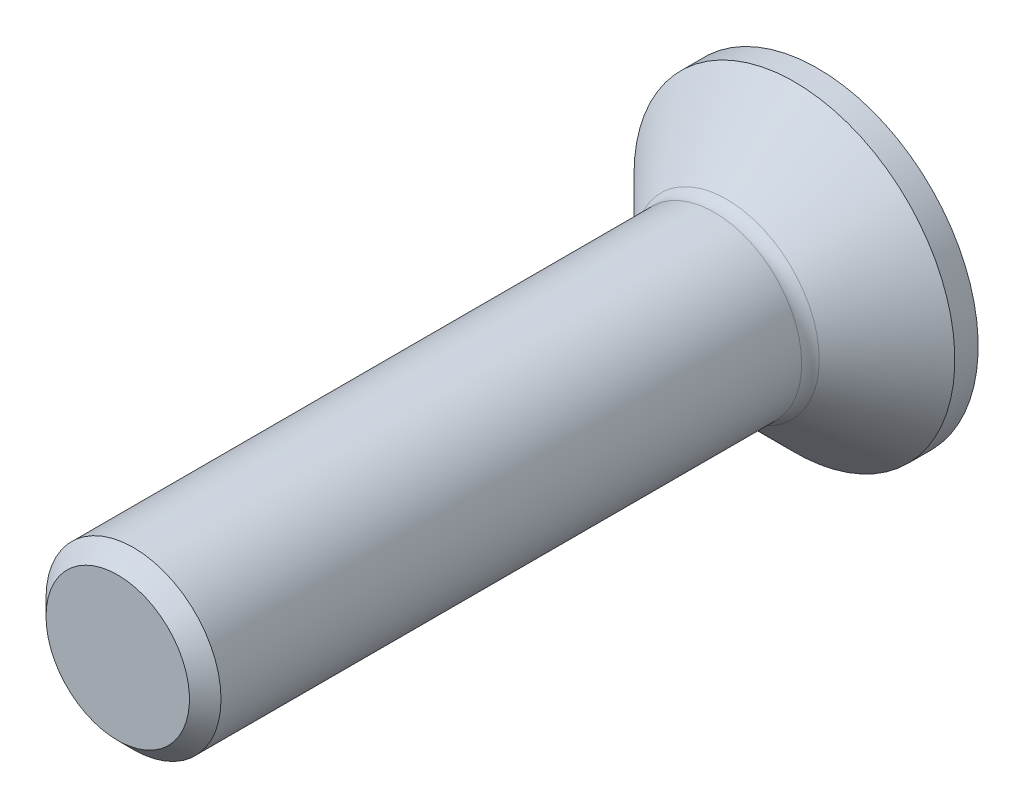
ISO-10303-21;
HEADER;
FILE_DESCRIPTION(('STEP AP214'),'2;1');
FILE_NAME('part.step','',(''),(''),'','','');
FILE_SCHEMA(('AUTOMOTIVE_DESIGN { 1 0 10303 214 1 1 1 1 }'));
ENDSEC;
DATA;
#1=APPLICATION_CONTEXT('core data for automotive mechanical design processes');
#2=APPLICATION_PROTOCOL_DEFINITION('international standard','automotive_design',2000,#1);
#3=PRODUCT_CONTEXT('',#1,'mechanical');
#4=PRODUCT('Part','Part','',(#3));
#5=PRODUCT_RELATED_PRODUCT_CATEGORY('part','',(#4));
#6=PRODUCT_DEFINITION_FORMATION('','',#4);
#7=PRODUCT_DEFINITION_CONTEXT('part definition',#1,'design');
#8=PRODUCT_DEFINITION('design','',#6,#7);
#9=PRODUCT_DEFINITION_SHAPE('','',#8);
#10=(LENGTH_UNIT() NAMED_UNIT(*) SI_UNIT(.MILLI.,.METRE.));
#11=(NAMED_UNIT(*) PLANE_ANGLE_UNIT() SI_UNIT($,.RADIAN.));
#12=(NAMED_UNIT(*) SI_UNIT($,.STERADIAN.) SOLID_ANGLE_UNIT());
#13=UNCERTAINTY_MEASURE_WITH_UNIT(LENGTH_MEASURE(1.E-05),#10,'distance_accuracy_value','');
#14=(GEOMETRIC_REPRESENTATION_CONTEXT(3) GLOBAL_UNCERTAINTY_ASSIGNED_CONTEXT((#13)) GLOBAL_UNIT_ASSIGNED_CONTEXT((#10,
#11,#12)) REPRESENTATION_CONTEXT('',''));
#15=CARTESIAN_POINT('',(0.,0.,0.));
#16=DIRECTION('',(0.,0.,1.));
#17=DIRECTION('',(1.,0.,0.));
#18=AXIS2_PLACEMENT_3D('',#15,#16,#17);
#19=CARTESIAN_POINT('',(0.,0.,-1.65));
#20=DIRECTION('',(0.,0.,-1.));
#21=DIRECTION('',(-1.,0.,0.));
#22=AXIS2_PLACEMENT_3D('',#19,#20,#21);
#23=CONICAL_SURFACE('',#22,3.15000000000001,0.78539816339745);
#24=CARTESIAN_POINT('',(0.,0.,-0.0878679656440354));
#25=DIRECTION('',(0.,0.,-1.));
#26=DIRECTION('',(-1.,0.,0.));
#27=AXIS2_PLACEMENT_3D('',#24,#25,#26);
#28=CIRCLE('',#27,1.58786796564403);
#29=CARTESIAN_POINT('',(-1.58786796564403,0.,-0.0878679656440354));
#30=VERTEX_POINT('',#29);
#31=EDGE_CURVE('E12',#30,#30,#28,.T.);
#32=ORIENTED_EDGE('',*,*,#31,.T.);
#33=EDGE_LOOP('',(#32));
#34=FACE_BOUND('',#33,.T.);
#35=CARTESIAN_POINT('',(0.,0.,-1.25));
#36=DIRECTION('',(0.,0.,-1.));
#37=DIRECTION('',(-1.,0.,0.));
#38=AXIS2_PLACEMENT_3D('',#35,#36,#37);
#39=CIRCLE('',#38,2.75);
#40=CARTESIAN_POINT('',(-2.75,0.,-1.25));
#41=VERTEX_POINT('',#40);
#42=EDGE_CURVE('E31',#41,#41,#39,.T.);
#43=ORIENTED_EDGE('',*,*,#42,.F.);
#44=EDGE_LOOP('',(#43));
#45=FACE_BOUND('',#44,.T.);
#46=ADVANCED_FACE('F27',(#34,#45),#23,.T.);
#47=CARTESIAN_POINT('',(0.,0.,10.35));
#48=DIRECTION('',(0.,0.,1.));
#49=DIRECTION('',(1.,0.,0.));
#50=AXIS2_PLACEMENT_3D('',#47,#48,#49);
#51=CYLINDRICAL_SURFACE('',#50,1.5);
#52=CARTESIAN_POINT('',(0.,0.,0.124264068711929));
#53=DIRECTION('',(0.,0.,1.));
#54=DIRECTION('',(1.,0.,0.));
#55=AXIS2_PLACEMENT_3D('',#52,#53,#54);
#56=CIRCLE('',#55,1.5);
#57=CARTESIAN_POINT('',(1.5,0.,0.124264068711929));
#58=VERTEX_POINT('',#57);
#59=EDGE_CURVE('E36',#58,#58,#56,.T.);
#60=ORIENTED_EDGE('',*,*,#59,.T.);
#61=EDGE_LOOP('',(#60));
#62=FACE_BOUND('',#61,.T.);
#63=CARTESIAN_POINT('',(0.,0.,10.079375));
#64=DIRECTION('',(0.,0.,-1.));
#65=DIRECTION('',(-1.,0.,0.));
#66=AXIS2_PLACEMENT_3D('',#63,#64,#65);
#67=CIRCLE('',#66,1.5);
#68=CARTESIAN_POINT('',(-1.5,0.,10.079375));
#69=VERTEX_POINT('',#68);
#70=EDGE_CURVE('E177',#69,#69,#67,.T.);
#71=ORIENTED_EDGE('',*,*,#70,.T.);
#72=EDGE_LOOP('',(#71));
#73=FACE_BOUND('',#72,.T.);
#74=ADVANCED_FACE('F29',(#62,#73),#51,.T.);
#75=CARTESIAN_POINT('',(0.,1.5,10.35));
#76=DIRECTION('',(0.,0.,-1.));
#77=DIRECTION('',(-1.,0.,0.));
#78=AXIS2_PLACEMENT_3D('',#75,#76,#77);
#79=PLANE('',#78);
#80=CARTESIAN_POINT('',(0.,0.,10.35));
#81=DIRECTION('',(0.,0.,-1.));
#82=DIRECTION('',(-1.,0.,0.));
#83=AXIS2_PLACEMENT_3D('',#80,#81,#82);
#84=CIRCLE('',#83,1.229375);
#85=CARTESIAN_POINT('',(-1.229375,0.,10.35));
#86=VERTEX_POINT('',#85);
#87=EDGE_CURVE('E174',#86,#86,#84,.F.);
#88=ORIENTED_EDGE('',*,*,#87,.T.);
#89=EDGE_LOOP('',(#88));
#90=FACE_BOUND('',#89,.T.);
#91=ADVANCED_FACE('F199',(#90),#79,.F.);
#92=CARTESIAN_POINT('',(0.,0.,10.35));
#93=DIRECTION('',(0.,0.,-1.));
#94=DIRECTION('',(-1.,0.,0.));
#95=AXIS2_PLACEMENT_3D('',#92,#93,#94);
#96=CONICAL_SURFACE('',#95,1.229375,0.785398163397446);
#97=ORIENTED_EDGE('',*,*,#70,.F.);
#98=EDGE_LOOP('',(#97));
#99=FACE_BOUND('',#98,.T.);
#100=ORIENTED_EDGE('',*,*,#87,.F.);
#101=EDGE_LOOP('',(#100));
#102=FACE_BOUND('',#101,.T.);
#103=ADVANCED_FACE('F188',(#99,#102),#96,.T.);
#104=CARTESIAN_POINT('',(0.,0.,0.124264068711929));
#105=DIRECTION('',(0.,0.,1.));
#106=DIRECTION('',(1.,0.,0.));
#107=AXIS2_PLACEMENT_3D('',#104,#105,#106);
#108=TOROIDAL_SURFACE('',#107,1.8,0.3);
#109=ORIENTED_EDGE('',*,*,#31,.F.);
#110=EDGE_LOOP('',(#109));
#111=FACE_BOUND('',#110,.T.);
#112=ORIENTED_EDGE('',*,*,#59,.F.);
#113=EDGE_LOOP('',(#112));
#114=FACE_BOUND('',#113,.T.);
#115=ADVANCED_FACE('F185',(#111,#114),#108,.F.);
#116=CARTESIAN_POINT('',(0.,0.,10.35));
#117=DIRECTION('',(0.,0.,-1.));
#118=DIRECTION('',(-1.,0.,0.));
#119=AXIS2_PLACEMENT_3D('',#116,#117,#118);
#120=CYLINDRICAL_SURFACE('',#119,2.75);
#121=CARTESIAN_POINT('',(0.,0.,-1.65));
#122=DIRECTION('',(0.,0.,-1.));
#123=DIRECTION('',(-1.,0.,0.));
#124=AXIS2_PLACEMENT_3D('',#121,#122,#123);
#125=CIRCLE('',#124,2.75);
#126=CARTESIAN_POINT('',(-2.75,0.,-1.65));
#127=VERTEX_POINT('',#126);
#128=EDGE_CURVE('E170',#127,#127,#125,.T.);
#129=ORIENTED_EDGE('',*,*,#128,.F.);
#130=EDGE_LOOP('',(#129));
#131=FACE_BOUND('',#130,.T.);
#132=ORIENTED_EDGE('',*,*,#42,.T.);
#133=EDGE_LOOP('',(#132));
#134=FACE_BOUND('',#133,.T.);
#135=ADVANCED_FACE('F187',(#131,#134),#120,.T.);
#136=CARTESIAN_POINT('',(0.,3.15000000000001,-1.65));
#137=DIRECTION('',(0.,0.,1.));
#138=DIRECTION('',(1.,0.,0.));
#139=AXIS2_PLACEMENT_3D('',#136,#137,#138);
#140=PLANE('',#139);
#141=DIRECTION('',(-0.499999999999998,-0.86602540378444,0.));
#142=VECTOR('',#141,1.);
#143=CARTESIAN_POINT('',(0.577350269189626,-1.,-1.65));
#144=LINE('',#143,#142);
#145=CARTESIAN_POINT('',(1.15470053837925,0.,-1.65));
#146=VERTEX_POINT('',#145);
#147=CARTESIAN_POINT('',(0.577350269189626,-1.,-1.65));
#148=VERTEX_POINT('',#147);
#149=EDGE_CURVE('E104',#146,#148,#144,.T.);
#150=ORIENTED_EDGE('',*,*,#149,.F.);
#151=DIRECTION('',(0.499999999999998,-0.86602540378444,0.));
#152=VECTOR('',#151,1.);
#153=CARTESIAN_POINT('',(1.15470053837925,0.,-1.65));
#154=LINE('',#153,#152);
#155=CARTESIAN_POINT('',(0.577350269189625,1.,-1.65));
#156=VERTEX_POINT('',#155);
#157=EDGE_CURVE('E43',#156,#146,#154,.T.);
#158=ORIENTED_EDGE('',*,*,#157,.F.);
#159=DIRECTION('',(1.,0.,0.));
#160=VECTOR('',#159,1.);
#161=CARTESIAN_POINT('',(0.577350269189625,1.,-1.65));
#162=LINE('',#161,#160);
#163=CARTESIAN_POINT('',(-0.577350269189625,1.,-1.65));
#164=VERTEX_POINT('',#163);
#165=EDGE_CURVE('E134',#164,#156,#162,.T.);
#166=ORIENTED_EDGE('',*,*,#165,.F.);
#167=DIRECTION('',(0.499999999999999,0.866025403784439,0.));
#168=VECTOR('',#167,1.);
#169=CARTESIAN_POINT('',(-0.577350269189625,1.,-1.65));
#170=LINE('',#169,#168);
#171=CARTESIAN_POINT('',(-1.15470053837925,0.,-1.65));
#172=VERTEX_POINT('',#171);
#173=EDGE_CURVE('E129',#172,#164,#170,.T.);
#174=ORIENTED_EDGE('',*,*,#173,.F.);
#175=DIRECTION('',(-0.499999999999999,0.866025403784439,0.));
#176=VECTOR('',#175,1.);
#177=CARTESIAN_POINT('',(-1.15470053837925,0.,-1.65));
#178=LINE('',#177,#176);
#179=CARTESIAN_POINT('',(-0.577350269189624,-1.,-1.65));
#180=VERTEX_POINT('',#179);
#181=EDGE_CURVE('E127',#180,#172,#178,.T.);
#182=ORIENTED_EDGE('',*,*,#181,.F.);
#183=DIRECTION('',(-1.,0.,0.));
#184=VECTOR('',#183,1.);
#185=CARTESIAN_POINT('',(-0.577350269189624,-1.,-1.65));
#186=LINE('',#185,#184);
#187=EDGE_CURVE('E112',#148,#180,#186,.T.);
#188=ORIENTED_EDGE('',*,*,#187,.F.);
#189=EDGE_LOOP('',(#150,#158,#166,#174,#182,#188));
#190=FACE_BOUND('',#189,.T.);
#191=ORIENTED_EDGE('',*,*,#128,.T.);
#192=EDGE_LOOP('',(#191));
#193=FACE_BOUND('',#192,.T.);
#194=ADVANCED_FACE('F124',(#190,#193),#140,.F.);
#195=CARTESIAN_POINT('',(1.15470053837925,0.,-0.6));
#196=DIRECTION('',(0.86602540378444,0.499999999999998,0.));
#197=DIRECTION('',(-0.499999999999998,0.86602540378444,0.));
#198=AXIS2_PLACEMENT_3D('',#195,#196,#197);
#199=PLANE('',#198);
#200=ORIENTED_EDGE('',*,*,#157,.T.);
#201=DIRECTION('',(0.,0.,-1.));
#202=VECTOR('',#201,1.);
#203=CARTESIAN_POINT('',(1.15470053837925,0.,-0.6));
#204=LINE('',#203,#202);
#205=CARTESIAN_POINT('',(1.15470053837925,0.,-0.6));
#206=VERTEX_POINT('',#205);
#207=EDGE_CURVE('E109',#206,#146,#204,.T.);
#208=ORIENTED_EDGE('',*,*,#207,.F.);
#209=DIRECTION('',(0.499999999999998,-0.86602540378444,0.));
#210=VECTOR('',#209,1.);
#211=CARTESIAN_POINT('',(1.15470053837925,0.,-0.6));
#212=LINE('',#211,#210);
#213=CARTESIAN_POINT('',(0.866025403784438,0.499999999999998,-0.6));
#214=VERTEX_POINT('',#213);
#215=EDGE_CURVE('E136',#214,#206,#212,.T.);
#216=ORIENTED_EDGE('',*,*,#215,.F.);
#217=CARTESIAN_POINT('',(0.577350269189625,1.,-0.6));
#218=VERTEX_POINT('',#217);
#219=EDGE_CURVE('E137',#218,#214,#212,.T.);
#220=ORIENTED_EDGE('',*,*,#219,.F.);
#221=DIRECTION('',(0.,0.,-1.));
#222=VECTOR('',#221,1.);
#223=CARTESIAN_POINT('',(0.577350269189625,1.,-0.6));
#224=LINE('',#223,#222);
#225=EDGE_CURVE('E156',#218,#156,#224,.T.);
#226=ORIENTED_EDGE('',*,*,#225,.T.);
#227=EDGE_LOOP('',(#200,#208,#216,#220,#226));
#228=FACE_BOUND('',#227,.T.);
#229=ADVANCED_FACE('F210',(#228),#199,.F.);
#230=CARTESIAN_POINT('',(0.577350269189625,1.,-0.6));
#231=DIRECTION('',(0.,1.,0.));
#232=DIRECTION('',(-1.,0.,0.));
#233=AXIS2_PLACEMENT_3D('',#230,#231,#232);
#234=PLANE('',#233);
#235=ORIENTED_EDGE('',*,*,#165,.T.);
#236=ORIENTED_EDGE('',*,*,#225,.F.);
#237=DIRECTION('',(1.,0.,0.));
#238=VECTOR('',#237,1.);
#239=CARTESIAN_POINT('',(0.577350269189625,1.,-0.6));
#240=LINE('',#239,#238);
#241=CARTESIAN_POINT('',(0.,0.999999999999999,-0.6));
#242=VERTEX_POINT('',#241);
#243=EDGE_CURVE('E152',#242,#218,#240,.T.);
#244=ORIENTED_EDGE('',*,*,#243,.F.);
#245=CARTESIAN_POINT('',(-0.577350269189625,1.,-0.6));
#246=VERTEX_POINT('',#245);
#247=EDGE_CURVE('E153',#246,#242,#240,.T.);
#248=ORIENTED_EDGE('',*,*,#247,.F.);
#249=DIRECTION('',(0.,0.,-1.));
#250=VECTOR('',#249,1.);
#251=CARTESIAN_POINT('',(-0.577350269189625,1.,-0.6));
#252=LINE('',#251,#250);
#253=EDGE_CURVE('E159',#246,#164,#252,.T.);
#254=ORIENTED_EDGE('',*,*,#253,.T.);
#255=EDGE_LOOP('',(#235,#236,#244,#248,#254));
#256=FACE_BOUND('',#255,.T.);
#257=ADVANCED_FACE('F254',(#256),#234,.F.);
#258=CARTESIAN_POINT('',(-0.577350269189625,1.,-0.6));
#259=DIRECTION('',(-0.866025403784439,0.499999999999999,0.));
#260=DIRECTION('',(-0.499999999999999,-0.866025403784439,0.));
#261=AXIS2_PLACEMENT_3D('',#258,#259,#260);
#262=PLANE('',#261);
#263=ORIENTED_EDGE('',*,*,#173,.T.);
#264=ORIENTED_EDGE('',*,*,#253,.F.);
#265=DIRECTION('',(0.499999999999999,0.866025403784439,0.));
#266=VECTOR('',#265,1.);
#267=CARTESIAN_POINT('',(-0.577350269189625,1.,-0.6));
#268=LINE('',#267,#266);
#269=CARTESIAN_POINT('',(-0.866025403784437,0.499999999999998,-0.6));
#270=VERTEX_POINT('',#269);
#271=EDGE_CURVE('E148',#270,#246,#268,.T.);
#272=ORIENTED_EDGE('',*,*,#271,.F.);
#273=CARTESIAN_POINT('',(-1.15470053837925,0.,-0.6));
#274=VERTEX_POINT('',#273);
#275=EDGE_CURVE('E149',#274,#270,#268,.T.);
#276=ORIENTED_EDGE('',*,*,#275,.F.);
#277=DIRECTION('',(0.,0.,-1.));
#278=VECTOR('',#277,1.);
#279=CARTESIAN_POINT('',(-1.15470053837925,0.,-0.6));
#280=LINE('',#279,#278);
#281=EDGE_CURVE('E162',#274,#172,#280,.T.);
#282=ORIENTED_EDGE('',*,*,#281,.T.);
#283=EDGE_LOOP('',(#263,#264,#272,#276,#282));
#284=FACE_BOUND('',#283,.T.);
#285=ADVANCED_FACE('F261',(#284),#262,.F.);
#286=CARTESIAN_POINT('',(-1.15470053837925,0.,-0.6));
#287=DIRECTION('',(-0.866025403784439,-0.499999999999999,0.));
#288=DIRECTION('',(0.499999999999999,-0.866025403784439,0.));
#289=AXIS2_PLACEMENT_3D('',#286,#287,#288);
#290=PLANE('',#289);
#291=ORIENTED_EDGE('',*,*,#181,.T.);
#292=ORIENTED_EDGE('',*,*,#281,.F.);
#293=DIRECTION('',(-0.499999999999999,0.866025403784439,0.));
#294=VECTOR('',#293,1.);
#295=CARTESIAN_POINT('',(-1.15470053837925,0.,-0.6));
#296=LINE('',#295,#294);
#297=CARTESIAN_POINT('',(-0.866025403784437,-0.499999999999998,-0.6));
#298=VERTEX_POINT('',#297);
#299=EDGE_CURVE('E144',#298,#274,#296,.T.);
#300=ORIENTED_EDGE('',*,*,#299,.F.);
#301=CARTESIAN_POINT('',(-0.577350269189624,-1.,-0.6));
#302=VERTEX_POINT('',#301);
#303=EDGE_CURVE('E145',#302,#298,#296,.T.);
#304=ORIENTED_EDGE('',*,*,#303,.F.);
#305=DIRECTION('',(0.,0.,-1.));
#306=VECTOR('',#305,1.);
#307=CARTESIAN_POINT('',(-0.577350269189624,-1.,-0.6));
#308=LINE('',#307,#306);
#309=EDGE_CURVE('E121',#302,#180,#308,.T.);
#310=ORIENTED_EDGE('',*,*,#309,.T.);
#311=EDGE_LOOP('',(#291,#292,#300,#304,#310));
#312=FACE_BOUND('',#311,.T.);
#313=ADVANCED_FACE('F269',(#312),#290,.F.);
#314=CARTESIAN_POINT('',(-0.577350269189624,-1.,-0.6));
#315=DIRECTION('',(0.,-1.,0.));
#316=DIRECTION('',(1.,0.,0.));
#317=AXIS2_PLACEMENT_3D('',#314,#315,#316);
#318=PLANE('',#317);
#319=ORIENTED_EDGE('',*,*,#187,.T.);
#320=ORIENTED_EDGE('',*,*,#309,.F.);
#321=DIRECTION('',(-1.,0.,0.));
#322=VECTOR('',#321,1.);
#323=CARTESIAN_POINT('',(-0.577350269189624,-1.,-0.6));
#324=LINE('',#323,#322);
#325=CARTESIAN_POINT('',(0.,-0.999999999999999,-0.6));
#326=VERTEX_POINT('',#325);
#327=EDGE_CURVE('E142',#326,#302,#324,.T.);
#328=ORIENTED_EDGE('',*,*,#327,.F.);
#329=CARTESIAN_POINT('',(0.577350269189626,-1.,-0.6));
#330=VERTEX_POINT('',#329);
#331=EDGE_CURVE('E120',#330,#326,#324,.T.);
#332=ORIENTED_EDGE('',*,*,#331,.F.);
#333=DIRECTION('',(0.,0.,-1.));
#334=VECTOR('',#333,1.);
#335=CARTESIAN_POINT('',(0.577350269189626,-1.,-0.6));
#336=LINE('',#335,#334);
#337=EDGE_CURVE('E107',#330,#148,#336,.T.);
#338=ORIENTED_EDGE('',*,*,#337,.T.);
#339=EDGE_LOOP('',(#319,#320,#328,#332,#338));
#340=FACE_BOUND('',#339,.T.);
#341=ADVANCED_FACE('F115',(#340),#318,.F.);
#342=CARTESIAN_POINT('',(0.577350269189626,-1.,-0.6));
#343=DIRECTION('',(0.86602540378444,-0.499999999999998,0.));
#344=DIRECTION('',(0.499999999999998,0.86602540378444,0.));
#345=AXIS2_PLACEMENT_3D('',#342,#343,#344);
#346=PLANE('',#345);
#347=ORIENTED_EDGE('',*,*,#149,.T.);
#348=ORIENTED_EDGE('',*,*,#337,.F.);
#349=DIRECTION('',(-0.499999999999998,-0.86602540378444,0.));
#350=VECTOR('',#349,1.);
#351=CARTESIAN_POINT('',(0.577350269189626,-1.,-0.6));
#352=LINE('',#351,#350);
#353=CARTESIAN_POINT('',(0.86602540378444,-0.499999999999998,-0.6));
#354=VERTEX_POINT('',#353);
#355=EDGE_CURVE('E140',#354,#330,#352,.T.);
#356=ORIENTED_EDGE('',*,*,#355,.F.);
#357=EDGE_CURVE('E51',#206,#354,#352,.T.);
#358=ORIENTED_EDGE('',*,*,#357,.F.);
#359=ORIENTED_EDGE('',*,*,#207,.T.);
#360=EDGE_LOOP('',(#347,#348,#356,#358,#359));
#361=FACE_BOUND('',#360,.T.);
#362=ADVANCED_FACE('F106',(#361),#346,.F.);
#363=CARTESIAN_POINT('',(0.577350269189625,1.,-0.6));
#364=DIRECTION('',(0.,0.,1.));
#365=DIRECTION('',(1.,0.,0.));
#366=AXIS2_PLACEMENT_3D('',#363,#364,#365);
#367=PLANE('',#366);
#368=ORIENTED_EDGE('',*,*,#355,.T.);
#369=ORIENTED_EDGE('',*,*,#331,.T.);
#370=CARTESIAN_POINT('',(0.,0.,-0.6));
#371=DIRECTION('',(0.,0.,-1.));
#372=DIRECTION('',(-1.,0.,0.));
#373=AXIS2_PLACEMENT_3D('',#370,#371,#372);
#374=CIRCLE('',#373,1.);
#375=EDGE_CURVE('E337',#354,#326,#374,.T.);
#376=ORIENTED_EDGE('',*,*,#375,.F.);
#377=EDGE_LOOP('',(#368,#369,#376));
#378=FACE_BOUND('',#377,.T.);
#379=ADVANCED_FACE('F290',(#378),#367,.F.);
#380=ORIENTED_EDGE('',*,*,#327,.T.);
#381=ORIENTED_EDGE('',*,*,#303,.T.);
#382=EDGE_CURVE('E340',#326,#298,#374,.T.);
#383=ORIENTED_EDGE('',*,*,#382,.F.);
#384=EDGE_LOOP('',(#380,#381,#383));
#385=FACE_BOUND('',#384,.T.);
#386=ADVANCED_FACE('F297',(#385),#367,.F.);
#387=ORIENTED_EDGE('',*,*,#299,.T.);
#388=ORIENTED_EDGE('',*,*,#275,.T.);
#389=EDGE_CURVE('E158',#298,#270,#374,.T.);
#390=ORIENTED_EDGE('',*,*,#389,.F.);
#391=EDGE_LOOP('',(#387,#388,#390));
#392=FACE_BOUND('',#391,.T.);
#393=ADVANCED_FACE('F305',(#392),#367,.F.);
#394=ORIENTED_EDGE('',*,*,#271,.T.);
#395=ORIENTED_EDGE('',*,*,#247,.T.);
#396=EDGE_CURVE('E167',#270,#242,#374,.T.);
#397=ORIENTED_EDGE('',*,*,#396,.F.);
#398=EDGE_LOOP('',(#394,#395,#397));
#399=FACE_BOUND('',#398,.T.);
#400=ADVANCED_FACE('F312',(#399),#367,.F.);
#401=ORIENTED_EDGE('',*,*,#243,.T.);
#402=ORIENTED_EDGE('',*,*,#219,.T.);
#403=EDGE_CURVE('E171',#242,#214,#374,.T.);
#404=ORIENTED_EDGE('',*,*,#403,.F.);
#405=EDGE_LOOP('',(#401,#402,#404));
#406=FACE_BOUND('',#405,.T.);
#407=ADVANCED_FACE('F319',(#406),#367,.F.);
#408=ORIENTED_EDGE('',*,*,#215,.T.);
#409=ORIENTED_EDGE('',*,*,#357,.T.);
#410=EDGE_CURVE('E333',#214,#354,#374,.T.);
#411=ORIENTED_EDGE('',*,*,#410,.F.);
#412=EDGE_LOOP('',(#408,#409,#411));
#413=FACE_BOUND('',#412,.T.);
#414=ADVANCED_FACE('F246',(#413),#367,.F.);
#415=CARTESIAN_POINT('',(0.,0.,-0.6));
#416=DIRECTION('',(0.,0.,-1.));
#417=DIRECTION('',(-1.,0.,0.));
#418=AXIS2_PLACEMENT_3D('',#415,#416,#417);
#419=CONICAL_SURFACE('',#418,1.,1.0471975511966);
#420=CARTESIAN_POINT('',(0.,0.,-0.0226497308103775));
#421=VERTEX_POINT('',#420);
#422=VERTEX_LOOP('',#421);
#423=FACE_BOUND('',#422,.T.);
#424=ORIENTED_EDGE('',*,*,#396,.T.);
#425=ORIENTED_EDGE('',*,*,#403,.T.);
#426=ORIENTED_EDGE('',*,*,#410,.T.);
#427=ORIENTED_EDGE('',*,*,#375,.T.);
#428=ORIENTED_EDGE('',*,*,#382,.T.);
#429=ORIENTED_EDGE('',*,*,#389,.T.);
#430=EDGE_LOOP('',(#424,#425,#426,#427,#428,#429));
#431=FACE_BOUND('',#430,.T.);
#432=ADVANCED_FACE('F241',(#423,#431),#419,.F.);
#433=CLOSED_SHELL('',(#46,#74,#91,#103,#115,#135,#194,#229,#257,#285,#313,#341,#362,#379,#386,
#393,#400,#407,#414,#432));
#434=MANIFOLD_SOLID_BREP('B2',#433);
#435=ADVANCED_BREP_SHAPE_REPRESENTATION('',(#18,#434),#14);
#436=SHAPE_DEFINITION_REPRESENTATION(#9,#435);
ENDSEC;
END-ISO-10303-21;
